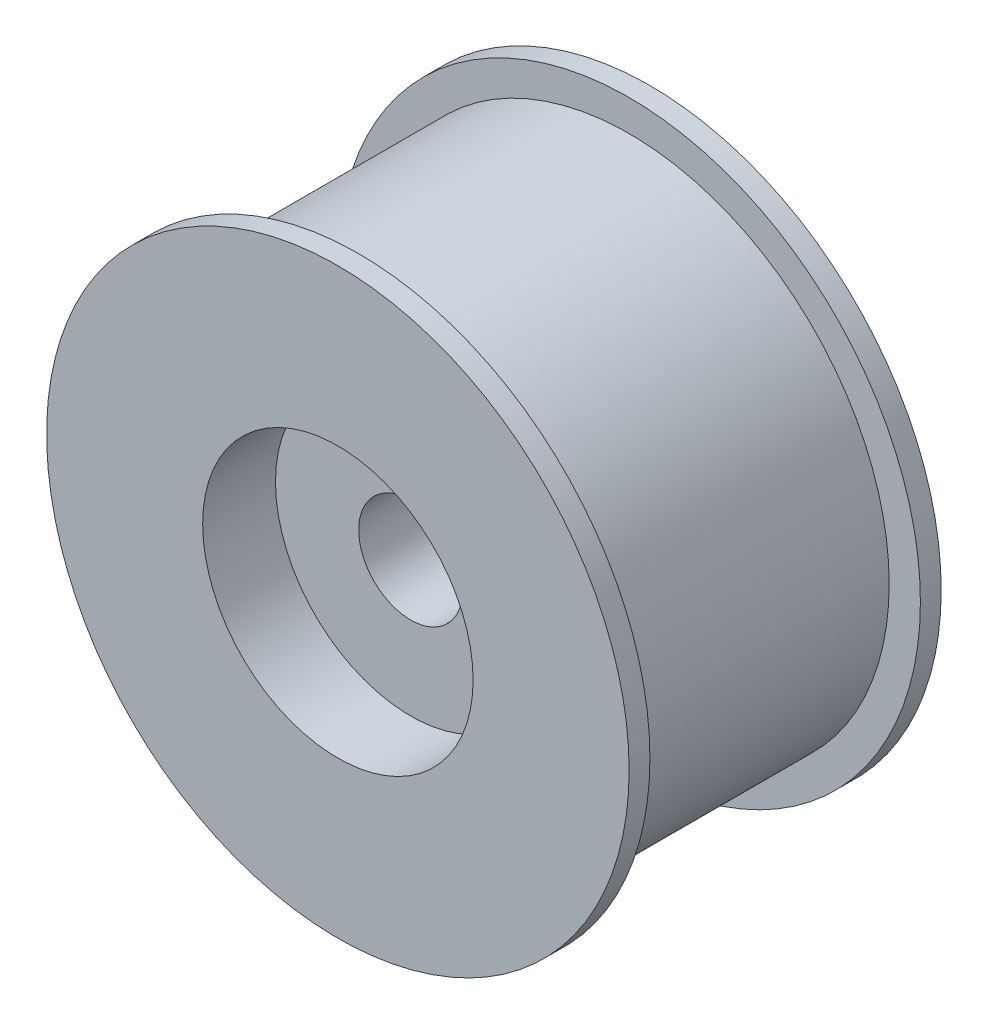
ISO-10303-21;
HEADER;
FILE_DESCRIPTION(('STEP AP214'),'2;1');
FILE_NAME('part.step','',(''),(''),'','','');
FILE_SCHEMA(('AUTOMOTIVE_DESIGN { 1 0 10303 214 1 1 1 1 }'));
ENDSEC;
DATA;
#1=APPLICATION_CONTEXT('core data for automotive mechanical design processes');
#2=APPLICATION_PROTOCOL_DEFINITION('international standard','automotive_design',2000,#1);
#3=PRODUCT_CONTEXT('',#1,'mechanical');
#4=PRODUCT('Part','Part','',(#3));
#5=PRODUCT_RELATED_PRODUCT_CATEGORY('part','',(#4));
#6=PRODUCT_DEFINITION_FORMATION('','',#4);
#7=PRODUCT_DEFINITION_CONTEXT('part definition',#1,'design');
#8=PRODUCT_DEFINITION('design','',#6,#7);
#9=PRODUCT_DEFINITION_SHAPE('','',#8);
#10=(LENGTH_UNIT() NAMED_UNIT(*) SI_UNIT(.MILLI.,.METRE.));
#11=(NAMED_UNIT(*) PLANE_ANGLE_UNIT() SI_UNIT($,.RADIAN.));
#12=(NAMED_UNIT(*) SI_UNIT($,.STERADIAN.) SOLID_ANGLE_UNIT());
#13=UNCERTAINTY_MEASURE_WITH_UNIT(LENGTH_MEASURE(1.E-05),#10,'distance_accuracy_value','');
#14=(GEOMETRIC_REPRESENTATION_CONTEXT(3) GLOBAL_UNCERTAINTY_ASSIGNED_CONTEXT((#13)) GLOBAL_UNIT_ASSIGNED_CONTEXT((#10,
#11,#12)) REPRESENTATION_CONTEXT('',''));
#15=CARTESIAN_POINT('',(0.,0.,0.));
#16=DIRECTION('',(0.,0.,1.));
#17=DIRECTION('',(1.,0.,0.));
#18=AXIS2_PLACEMENT_3D('',#15,#16,#17);
#19=CARTESIAN_POINT('',(0.,0.,15.3646380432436));
#20=DIRECTION('',(0.,0.,1.));
#21=DIRECTION('',(1.,0.,0.));
#22=AXIS2_PLACEMENT_3D('',#19,#20,#21);
#23=CYLINDRICAL_SURFACE('',#22,11.);
#24=CARTESIAN_POINT('',(0.,0.,-15.));
#25=DIRECTION('',(0.,0.,1.));
#26=DIRECTION('',(1.,0.,0.));
#27=AXIS2_PLACEMENT_3D('',#24,#25,#26);
#28=CIRCLE('',#27,11.);
#29=CARTESIAN_POINT('',(11.,0.,-15.));
#30=VERTEX_POINT('',#29);
#31=EDGE_CURVE('E8',#30,#30,#28,.T.);
#32=ORIENTED_EDGE('',*,*,#31,.F.);
#33=EDGE_LOOP('',(#32));
#34=FACE_BOUND('',#33,.T.);
#35=CARTESIAN_POINT('',(0.,0.,-8.));
#36=DIRECTION('',(0.,0.,1.));
#37=DIRECTION('',(1.,0.,0.));
#38=AXIS2_PLACEMENT_3D('',#35,#36,#37);
#39=CIRCLE('',#38,11.);
#40=CARTESIAN_POINT('',(11.,0.,-8.));
#41=VERTEX_POINT('',#40);
#42=EDGE_CURVE('E52',#41,#41,#39,.T.);
#43=ORIENTED_EDGE('',*,*,#42,.T.);
#44=EDGE_LOOP('',(#43));
#45=FACE_BOUND('',#44,.T.);
#46=ADVANCED_FACE('F12',(#34,#45),#23,.F.);
#47=CARTESIAN_POINT('',(0.,11.,-15.));
#48=DIRECTION('',(0.,0.,1.));
#49=DIRECTION('',(1.,0.,0.));
#50=AXIS2_PLACEMENT_3D('',#47,#48,#49);
#51=PLANE('',#50);
#52=CARTESIAN_POINT('',(0.,0.,-15.));
#53=DIRECTION('',(0.,0.,1.));
#54=DIRECTION('',(1.,0.,0.));
#55=AXIS2_PLACEMENT_3D('',#52,#53,#54);
#56=CIRCLE('',#55,28.);
#57=CARTESIAN_POINT('',(28.,0.,-15.));
#58=VERTEX_POINT('',#57);
#59=EDGE_CURVE('E18',#58,#58,#56,.T.);
#60=ORIENTED_EDGE('',*,*,#59,.F.);
#61=EDGE_LOOP('',(#60));
#62=FACE_BOUND('',#61,.T.);
#63=ORIENTED_EDGE('',*,*,#31,.T.);
#64=EDGE_LOOP('',(#63));
#65=FACE_BOUND('',#64,.T.);
#66=ADVANCED_FACE('F113',(#62,#65),#51,.F.);
#67=CARTESIAN_POINT('',(0.,0.,15.3646380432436));
#68=DIRECTION('',(0.,0.,1.));
#69=DIRECTION('',(1.,0.,0.));
#70=AXIS2_PLACEMENT_3D('',#67,#68,#69);
#71=CYLINDRICAL_SURFACE('',#70,28.);
#72=CARTESIAN_POINT('',(0.,0.,-13.));
#73=DIRECTION('',(0.,0.,1.));
#74=DIRECTION('',(1.,0.,0.));
#75=AXIS2_PLACEMENT_3D('',#72,#73,#74);
#76=CIRCLE('',#75,28.);
#77=CARTESIAN_POINT('',(28.,0.,-13.));
#78=VERTEX_POINT('',#77);
#79=EDGE_CURVE('E22',#78,#78,#76,.T.);
#80=ORIENTED_EDGE('',*,*,#79,.F.);
#81=EDGE_LOOP('',(#80));
#82=FACE_BOUND('',#81,.T.);
#83=ORIENTED_EDGE('',*,*,#59,.T.);
#84=EDGE_LOOP('',(#83));
#85=FACE_BOUND('',#84,.T.);
#86=ADVANCED_FACE('F108',(#82,#85),#71,.T.);
#87=CARTESIAN_POINT('',(0.,28.,-13.));
#88=DIRECTION('',(0.,0.,-1.));
#89=DIRECTION('',(-1.,0.,0.));
#90=AXIS2_PLACEMENT_3D('',#87,#88,#89);
#91=PLANE('',#90);
#92=CARTESIAN_POINT('',(0.,0.,-13.));
#93=DIRECTION('',(0.,0.,1.));
#94=DIRECTION('',(1.,0.,0.));
#95=AXIS2_PLACEMENT_3D('',#92,#93,#94);
#96=CIRCLE('',#95,25.);
#97=CARTESIAN_POINT('',(25.,0.,-13.));
#98=VERTEX_POINT('',#97);
#99=EDGE_CURVE('E26',#98,#98,#96,.T.);
#100=ORIENTED_EDGE('',*,*,#99,.F.);
#101=EDGE_LOOP('',(#100));
#102=FACE_BOUND('',#101,.T.);
#103=ORIENTED_EDGE('',*,*,#79,.T.);
#104=EDGE_LOOP('',(#103));
#105=FACE_BOUND('',#104,.T.);
#106=ADVANCED_FACE('F102',(#102,#105),#91,.F.);
#107=CARTESIAN_POINT('',(0.,0.,15.3646380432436));
#108=DIRECTION('',(0.,0.,1.));
#109=DIRECTION('',(1.,0.,0.));
#110=AXIS2_PLACEMENT_3D('',#107,#108,#109);
#111=CYLINDRICAL_SURFACE('',#110,25.);
#112=CARTESIAN_POINT('',(0.,0.,13.));
#113=DIRECTION('',(0.,0.,1.));
#114=DIRECTION('',(1.,0.,0.));
#115=AXIS2_PLACEMENT_3D('',#112,#113,#114);
#116=CIRCLE('',#115,25.);
#117=CARTESIAN_POINT('',(25.,0.,13.));
#118=VERTEX_POINT('',#117);
#119=EDGE_CURVE('E31',#118,#118,#116,.T.);
#120=ORIENTED_EDGE('',*,*,#119,.F.);
#121=EDGE_LOOP('',(#120));
#122=FACE_BOUND('',#121,.T.);
#123=ORIENTED_EDGE('',*,*,#99,.T.);
#124=EDGE_LOOP('',(#123));
#125=FACE_BOUND('',#124,.T.);
#126=ADVANCED_FACE('F96',(#122,#125),#111,.T.);
#127=CARTESIAN_POINT('',(0.,25.,13.));
#128=DIRECTION('',(0.,0.,1.));
#129=DIRECTION('',(1.,0.,0.));
#130=AXIS2_PLACEMENT_3D('',#127,#128,#129);
#131=PLANE('',#130);
#132=CARTESIAN_POINT('',(0.,0.,13.));
#133=DIRECTION('',(0.,0.,1.));
#134=DIRECTION('',(1.,0.,0.));
#135=AXIS2_PLACEMENT_3D('',#132,#133,#134);
#136=CIRCLE('',#135,28.);
#137=CARTESIAN_POINT('',(28.,0.,13.));
#138=VERTEX_POINT('',#137);
#139=EDGE_CURVE('E34',#138,#138,#136,.T.);
#140=ORIENTED_EDGE('',*,*,#139,.F.);
#141=EDGE_LOOP('',(#140));
#142=FACE_BOUND('',#141,.T.);
#143=ORIENTED_EDGE('',*,*,#119,.T.);
#144=EDGE_LOOP('',(#143));
#145=FACE_BOUND('',#144,.T.);
#146=ADVANCED_FACE('F90',(#142,#145),#131,.F.);
#147=CARTESIAN_POINT('',(0.,0.,15.3646380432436));
#148=DIRECTION('',(0.,0.,1.));
#149=DIRECTION('',(1.,0.,0.));
#150=AXIS2_PLACEMENT_3D('',#147,#148,#149);
#151=CYLINDRICAL_SURFACE('',#150,28.);
#152=CARTESIAN_POINT('',(0.,0.,15.));
#153=DIRECTION('',(0.,0.,1.));
#154=DIRECTION('',(1.,0.,0.));
#155=AXIS2_PLACEMENT_3D('',#152,#153,#154);
#156=CIRCLE('',#155,28.);
#157=CARTESIAN_POINT('',(28.,0.,15.));
#158=VERTEX_POINT('',#157);
#159=EDGE_CURVE('E37',#158,#158,#156,.T.);
#160=ORIENTED_EDGE('',*,*,#159,.F.);
#161=EDGE_LOOP('',(#160));
#162=FACE_BOUND('',#161,.T.);
#163=ORIENTED_EDGE('',*,*,#139,.T.);
#164=EDGE_LOOP('',(#163));
#165=FACE_BOUND('',#164,.T.);
#166=ADVANCED_FACE('F84',(#162,#165),#151,.T.);
#167=CARTESIAN_POINT('',(0.,28.,15.));
#168=DIRECTION('',(0.,0.,-1.));
#169=DIRECTION('',(-1.,0.,0.));
#170=AXIS2_PLACEMENT_3D('',#167,#168,#169);
#171=PLANE('',#170);
#172=CARTESIAN_POINT('',(0.,0.,15.));
#173=DIRECTION('',(0.,0.,1.));
#174=DIRECTION('',(1.,0.,0.));
#175=AXIS2_PLACEMENT_3D('',#172,#173,#174);
#176=CIRCLE('',#175,13.);
#177=CARTESIAN_POINT('',(13.,0.,15.));
#178=VERTEX_POINT('',#177);
#179=EDGE_CURVE('E40',#178,#178,#176,.T.);
#180=ORIENTED_EDGE('',*,*,#179,.F.);
#181=EDGE_LOOP('',(#180));
#182=FACE_BOUND('',#181,.T.);
#183=ORIENTED_EDGE('',*,*,#159,.T.);
#184=EDGE_LOOP('',(#183));
#185=FACE_BOUND('',#184,.T.);
#186=ADVANCED_FACE('F78',(#182,#185),#171,.F.);
#187=CARTESIAN_POINT('',(0.,0.,15.3646380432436));
#188=DIRECTION('',(0.,0.,1.));
#189=DIRECTION('',(1.,0.,0.));
#190=AXIS2_PLACEMENT_3D('',#187,#188,#189);
#191=CYLINDRICAL_SURFACE('',#190,13.);
#192=CARTESIAN_POINT('',(0.,0.,8.));
#193=DIRECTION('',(0.,0.,1.));
#194=DIRECTION('',(1.,0.,0.));
#195=AXIS2_PLACEMENT_3D('',#192,#193,#194);
#196=CIRCLE('',#195,13.);
#197=CARTESIAN_POINT('',(13.,0.,8.));
#198=VERTEX_POINT('',#197);
#199=EDGE_CURVE('E43',#198,#198,#196,.T.);
#200=ORIENTED_EDGE('',*,*,#199,.F.);
#201=EDGE_LOOP('',(#200));
#202=FACE_BOUND('',#201,.T.);
#203=ORIENTED_EDGE('',*,*,#179,.T.);
#204=EDGE_LOOP('',(#203));
#205=FACE_BOUND('',#204,.T.);
#206=ADVANCED_FACE('F72',(#202,#205),#191,.F.);
#207=CARTESIAN_POINT('',(0.,13.,8.));
#208=DIRECTION('',(0.,0.,-1.));
#209=DIRECTION('',(-1.,0.,0.));
#210=AXIS2_PLACEMENT_3D('',#207,#208,#209);
#211=PLANE('',#210);
#212=CARTESIAN_POINT('',(0.,0.,8.));
#213=DIRECTION('',(0.,0.,1.));
#214=DIRECTION('',(1.,0.,0.));
#215=AXIS2_PLACEMENT_3D('',#212,#213,#214);
#216=CIRCLE('',#215,5.);
#217=CARTESIAN_POINT('',(5.,0.,8.));
#218=VERTEX_POINT('',#217);
#219=EDGE_CURVE('E46',#218,#218,#216,.T.);
#220=ORIENTED_EDGE('',*,*,#219,.F.);
#221=EDGE_LOOP('',(#220));
#222=FACE_BOUND('',#221,.T.);
#223=ORIENTED_EDGE('',*,*,#199,.T.);
#224=EDGE_LOOP('',(#223));
#225=FACE_BOUND('',#224,.T.);
#226=ADVANCED_FACE('F66',(#222,#225),#211,.F.);
#227=CARTESIAN_POINT('',(0.,0.,15.3646380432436));
#228=DIRECTION('',(0.,0.,1.));
#229=DIRECTION('',(1.,0.,0.));
#230=AXIS2_PLACEMENT_3D('',#227,#228,#229);
#231=CYLINDRICAL_SURFACE('',#230,5.);
#232=CARTESIAN_POINT('',(0.,0.,-8.));
#233=DIRECTION('',(0.,0.,1.));
#234=DIRECTION('',(1.,0.,0.));
#235=AXIS2_PLACEMENT_3D('',#232,#233,#234);
#236=CIRCLE('',#235,5.);
#237=CARTESIAN_POINT('',(5.,0.,-8.));
#238=VERTEX_POINT('',#237);
#239=EDGE_CURVE('E49',#238,#238,#236,.T.);
#240=ORIENTED_EDGE('',*,*,#239,.F.);
#241=EDGE_LOOP('',(#240));
#242=FACE_BOUND('',#241,.T.);
#243=ORIENTED_EDGE('',*,*,#219,.T.);
#244=EDGE_LOOP('',(#243));
#245=FACE_BOUND('',#244,.T.);
#246=ADVANCED_FACE('F60',(#242,#245),#231,.F.);
#247=CARTESIAN_POINT('',(0.,5.,-8.));
#248=DIRECTION('',(0.,0.,1.));
#249=DIRECTION('',(1.,0.,0.));
#250=AXIS2_PLACEMENT_3D('',#247,#248,#249);
#251=PLANE('',#250);
#252=ORIENTED_EDGE('',*,*,#42,.F.);
#253=EDGE_LOOP('',(#252));
#254=FACE_BOUND('',#253,.T.);
#255=ORIENTED_EDGE('',*,*,#239,.T.);
#256=EDGE_LOOP('',(#255));
#257=FACE_BOUND('',#256,.T.);
#258=ADVANCED_FACE('F57',(#254,#257),#251,.F.);
#259=CLOSED_SHELL('',(#46,#66,#86,#106,#126,#146,#166,#186,#206,#226,#246,#258));
#260=MANIFOLD_SOLID_BREP('B1',#259);
#261=ADVANCED_BREP_SHAPE_REPRESENTATION('',(#18,#260),#14);
#262=SHAPE_DEFINITION_REPRESENTATION(#9,#261);
ENDSEC;
END-ISO-10303-21;
